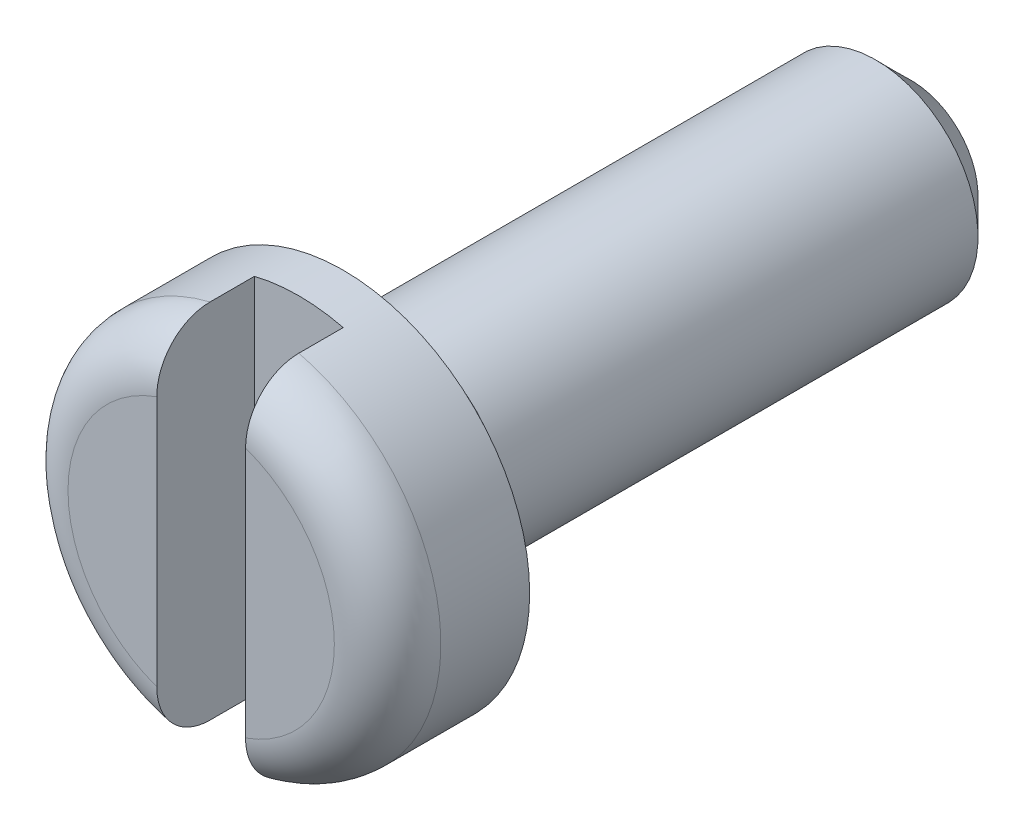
ISO-10303-21;
HEADER;
FILE_DESCRIPTION(('STEP AP214'),'2;1');
FILE_NAME('part.step','',(''),(''),'','','');
FILE_SCHEMA(('AUTOMOTIVE_DESIGN { 1 0 10303 214 1 1 1 1 }'));
ENDSEC;
DATA;
#1=APPLICATION_CONTEXT('core data for automotive mechanical design processes');
#2=APPLICATION_PROTOCOL_DEFINITION('international standard','automotive_design',2000,#1);
#3=PRODUCT_CONTEXT('',#1,'mechanical');
#4=PRODUCT('Part','Part','',(#3));
#5=PRODUCT_RELATED_PRODUCT_CATEGORY('part','',(#4));
#6=PRODUCT_DEFINITION_FORMATION('','',#4);
#7=PRODUCT_DEFINITION_CONTEXT('part definition',#1,'design');
#8=PRODUCT_DEFINITION('design','',#6,#7);
#9=PRODUCT_DEFINITION_SHAPE('','',#8);
#10=(LENGTH_UNIT() NAMED_UNIT(*) SI_UNIT(.MILLI.,.METRE.));
#11=(NAMED_UNIT(*) PLANE_ANGLE_UNIT() SI_UNIT($,.RADIAN.));
#12=(NAMED_UNIT(*) SI_UNIT($,.STERADIAN.) SOLID_ANGLE_UNIT());
#13=UNCERTAINTY_MEASURE_WITH_UNIT(LENGTH_MEASURE(1.E-05),#10,'distance_accuracy_value','');
#14=(GEOMETRIC_REPRESENTATION_CONTEXT(3) GLOBAL_UNCERTAINTY_ASSIGNED_CONTEXT((#13)) GLOBAL_UNIT_ASSIGNED_CONTEXT((#10,
#11,#12)) REPRESENTATION_CONTEXT('',''));
#15=CARTESIAN_POINT('',(0.,0.,0.));
#16=DIRECTION('',(0.,0.,1.));
#17=DIRECTION('',(1.,0.,0.));
#18=AXIS2_PLACEMENT_3D('',#15,#16,#17);
#19=CARTESIAN_POINT('',(0.,0.,1.6));
#20=DIRECTION('',(0.,0.,1.));
#21=DIRECTION('',(1.,0.,0.));
#22=AXIS2_PLACEMENT_3D('',#19,#20,#21);
#23=PLANE('',#22);
#24=DIRECTION('',(0.,-1.,0.));
#25=VECTOR('',#24,1.);
#26=CARTESIAN_POINT('',(-0.5,0.,1.6));
#27=LINE('',#26,#25);
#28=CARTESIAN_POINT('',(-0.5,1.4142135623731,1.6));
#29=VERTEX_POINT('',#28);
#30=CARTESIAN_POINT('',(-0.5,-1.4142135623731,1.6));
#31=VERTEX_POINT('',#30);
#32=EDGE_CURVE('E95',#29,#31,#27,.T.);
#33=ORIENTED_EDGE('',*,*,#32,.F.);
#34=CARTESIAN_POINT('',(0.,0.,1.6));
#35=DIRECTION('',(0.,0.,1.));
#36=DIRECTION('',(1.,0.,0.));
#37=AXIS2_PLACEMENT_3D('',#34,#35,#36);
#38=CIRCLE('',#37,1.5);
#39=EDGE_CURVE('E119',#29,#31,#38,.T.);
#40=ORIENTED_EDGE('',*,*,#39,.T.);
#41=EDGE_LOOP('',(#33,#40));
#42=FACE_BOUND('',#41,.T.);
#43=ADVANCED_FACE('F24',(#42),#23,.T.);
#44=CARTESIAN_POINT('',(0.,0.,1.));
#45=DIRECTION('',(0.,0.,1.));
#46=DIRECTION('',(1.,0.,0.));
#47=AXIS2_PLACEMENT_3D('',#44,#45,#46);
#48=TOROIDAL_SURFACE('',#47,1.5,0.6);
#49=CARTESIAN_POINT('',(-0.5,-1.99964689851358,1.21223347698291));
#50=CARTESIAN_POINT('',(-0.5,-2.01156673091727,1.18165302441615));
#51=CARTESIAN_POINT('',(-0.5,-2.02092214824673,1.15006159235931));
#52=CARTESIAN_POINT('',(-0.5,-2.03420012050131,1.08574395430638));
#53=CARTESIAN_POINT('',(-0.5,-2.03811994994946,1.05301718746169));
#54=CARTESIAN_POINT('',(-0.5,-2.04039563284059,0.987371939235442));
#55=CARTESIAN_POINT('',(-0.5,-2.03875192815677,0.954453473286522));
#56=CARTESIAN_POINT('',(-0.5,-2.02995378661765,0.889365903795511));
#57=CARTESIAN_POINT('',(-0.5,-2.02279989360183,0.857196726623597));
#58=CARTESIAN_POINT('',(-0.5,-2.00321865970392,0.794539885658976));
#59=CARTESIAN_POINT('',(-0.5,-1.99079615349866,0.764050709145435));
#60=CARTESIAN_POINT('',(-0.5,-1.96106630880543,0.705557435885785));
#61=CARTESIAN_POINT('',(-0.5,-1.94375877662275,0.677553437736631));
#62=CARTESIAN_POINT('',(-0.5,-1.90455349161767,0.6244526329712));
#63=CARTESIAN_POINT('',(-0.5,-1.88260363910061,0.599394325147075));
#64=CARTESIAN_POINT('',(-0.5,-1.83490308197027,0.553207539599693));
#65=CARTESIAN_POINT('',(-0.5,-1.80915201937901,0.532079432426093));
#66=CARTESIAN_POINT('',(-0.5,-1.75389034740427,0.493752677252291));
#67=CARTESIAN_POINT('',(-0.5,-1.7243002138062,0.476668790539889));
#68=CARTESIAN_POINT('',(-0.5,-1.66275438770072,0.447501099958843));
#69=CARTESIAN_POINT('',(-0.5,-1.63079832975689,0.435418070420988));
#70=CARTESIAN_POINT('',(-0.5,-1.56410675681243,0.416073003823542));
#71=CARTESIAN_POINT('',(-0.5,-1.52931144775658,0.409017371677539));
#72=CARTESIAN_POINT('',(-0.5,-1.45904380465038,0.400550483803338));
#73=CARTESIAN_POINT('',(-0.5,-1.42357131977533,0.399140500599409));
#74=CARTESIAN_POINT('',(-0.5,-1.35108451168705,0.401927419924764));
#75=CARTESIAN_POINT('',(-0.5,-1.31408104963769,0.406406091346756));
#76=CARTESIAN_POINT('',(-0.5,-1.24126423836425,0.421208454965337));
#77=CARTESIAN_POINT('',(-0.5,-1.20545115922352,0.431533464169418));
#78=CARTESIAN_POINT('',(-0.5,-1.13417944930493,0.458325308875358));
#79=CARTESIAN_POINT('',(-0.5,-1.09882466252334,0.475068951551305));
#80=CARTESIAN_POINT('',(-0.5,-1.0313298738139,0.514163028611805));
#81=CARTESIAN_POINT('',(-0.5,-0.99919206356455,0.536517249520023));
#82=CARTESIAN_POINT('',(-0.5,-0.938652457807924,0.586745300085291));
#83=CARTESIAN_POINT('',(-0.5,-0.910319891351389,0.614702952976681));
#84=CARTESIAN_POINT('',(-0.5,-0.859233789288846,0.675318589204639));
#85=CARTESIAN_POINT('',(-0.5,-0.836472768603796,0.707970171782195));
#86=CARTESIAN_POINT('',(-0.5,-0.802490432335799,0.768994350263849));
#87=CARTESIAN_POINT('',(-0.5,-0.78981346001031,0.796558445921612));
#88=CARTESIAN_POINT('',(-0.5,-0.769222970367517,0.85340723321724));
#89=CARTESIAN_POINT('',(-0.5,-0.761304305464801,0.882690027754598));
#90=CARTESIAN_POINT('',(-0.5,-0.750757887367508,0.942341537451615));
#91=CARTESIAN_POINT('',(-0.5,-0.74815377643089,0.972714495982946));
#92=CARTESIAN_POINT('',(-0.5,-0.748528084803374,1.03342787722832));
#93=CARTESIAN_POINT('',(-0.5,-0.751506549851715,1.06376829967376));
#94=CARTESIAN_POINT('',(-0.5,-0.762394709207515,1.12132246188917));
#95=CARTESIAN_POINT('',(-0.5,-0.769943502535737,1.14860616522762));
#96=CARTESIAN_POINT('',(-0.5,-0.789179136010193,1.20166601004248));
#97=CARTESIAN_POINT('',(-0.5,-0.800867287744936,1.22744167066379));
#98=CARTESIAN_POINT('',(-0.5,-0.82889681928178,1.27899767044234));
#99=CARTESIAN_POINT('',(-0.5,-0.845533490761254,1.30461659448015));
#100=CARTESIAN_POINT('',(-0.5,-0.882315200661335,1.35319089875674));
#101=CARTESIAN_POINT('',(-0.5,-0.902461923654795,1.37614499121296));
#102=CARTESIAN_POINT('',(-0.5,-0.949067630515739,1.42246367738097));
#103=CARTESIAN_POINT('',(-0.5,-0.976021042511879,1.44533169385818));
#104=CARTESIAN_POINT('',(-0.5,-1.03306909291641,1.48674639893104));
#105=CARTESIAN_POINT('',(-0.5,-1.0631653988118,1.50529077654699));
#106=CARTESIAN_POINT('',(-0.5,-1.1291001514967,1.53941199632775));
#107=CARTESIAN_POINT('',(-0.5,-1.16520935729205,1.55446871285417));
#108=CARTESIAN_POINT('',(-0.5,-1.23942611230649,1.57840607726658));
#109=CARTESIAN_POINT('',(-0.5,-1.27753394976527,1.58728583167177));
#110=CARTESIAN_POINT('',(-0.5,-1.35523785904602,1.59856860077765));
#111=CARTESIAN_POINT('',(-0.5,-1.39484711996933,1.60088192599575));
#112=CARTESIAN_POINT('',(-0.5,-1.47386106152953,1.59851603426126));
#113=CARTESIAN_POINT('',(-0.5,-1.51326578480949,1.59383833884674));
#114=CARTESIAN_POINT('',(-0.5,-1.58894762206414,1.57778917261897));
#115=CARTESIAN_POINT('',(-0.5,-1.62528651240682,1.56670972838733));
#116=CARTESIAN_POINT('',(-0.5,-1.69542326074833,1.5382626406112));
#117=CARTESIAN_POINT('',(-0.5,-1.72922156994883,1.52089611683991));
#118=CARTESIAN_POINT('',(-0.5,-1.79139186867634,1.48138259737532));
#119=CARTESIAN_POINT('',(-0.5,-1.81995682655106,1.45953887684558));
#120=CARTESIAN_POINT('',(-0.5,-1.87278431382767,1.41117493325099));
#121=CARTESIAN_POINT('',(-0.5,-1.89705092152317,1.38465919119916));
#122=CARTESIAN_POINT('',(-0.5,-1.93549452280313,1.33423884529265));
#123=CARTESIAN_POINT('',(-0.5,-1.95071039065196,1.31111809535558));
#124=CARTESIAN_POINT('',(-0.5,-1.97777146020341,1.26298118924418));
#125=CARTESIAN_POINT('',(-0.5,-1.9896170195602,1.23796523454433));
#126=CARTESIAN_POINT('',(-0.5,-1.99964689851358,1.21223347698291));
#127=B_SPLINE_CURVE_WITH_KNOTS('',3,(#49,#50,#51,#52,#53,#54,#55,#56,#57,#58,#59,#60,#61,#62,
#63,#64,#65,#66,#67,#68,#69,#70,#71,#72,#73,#74,#75,#76,#77,#78,#79,#80,#81,#82,#83,#84,#85,#86,
#87,#88,#89,#90,#91,#92,#93,#94,#95,#96,#97,#98,#99,#100,#101,#102,#103,#104,#105,#106,#107,
#108,#109,#110,#111,#112,#113,#114,#115,#116,#117,#118,#119,#120,#121,#122,#123,#124,#125,#126),
.UNSPECIFIED.,.T.,.F.,(4,2,2,2,2,2,2,2,2,2,2,2,2,2,2,2,2,2,2,2,2,2,2,2,2,2,2,2,2,2,2,2,2,2,2,2,
2,2,4),(0.,0.0983660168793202,0.196781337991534,0.29518884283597,0.393586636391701,
0.491894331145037,0.590205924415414,0.689685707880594,0.789174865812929,0.891217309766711,
0.993275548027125,1.09931419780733,1.20537674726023,1.31670366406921,1.42805566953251,
1.54487799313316,1.66177937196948,1.78058119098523,1.89922251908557,1.98986685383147,
2.08041295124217,2.17136098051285,2.26230975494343,2.34687306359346,2.4314631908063,
2.52275501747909,2.61409077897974,2.71970201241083,2.8253695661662,2.94219498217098,
3.05903729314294,3.17746802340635,3.29587298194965,3.4092608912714,3.52262861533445,
3.62996855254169,3.73720609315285,3.8199844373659,3.90275399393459),.UNSPECIFIED.);
#128=CARTESIAN_POINT('',(-0.5,-2.03960780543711,1.));
#129=VERTEX_POINT('',#128);
#130=EDGE_CURVE('E47',#31,#129,#127,.T.);
#131=ORIENTED_EDGE('',*,*,#130,.F.);
#132=ORIENTED_EDGE('',*,*,#39,.F.);
#133=CARTESIAN_POINT('',(-0.5,0.772599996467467,1.15466697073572));
#134=CARTESIAN_POINT('',(-0.5,0.763899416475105,1.12728531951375));
#135=CARTESIAN_POINT('',(-0.5,0.757412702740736,1.09919049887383));
#136=CARTESIAN_POINT('',(-0.5,0.749307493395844,1.04230286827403));
#137=CARTESIAN_POINT('',(-0.5,0.747687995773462,1.01351020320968));
#138=CARTESIAN_POINT('',(-0.5,0.749438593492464,0.956074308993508));
#139=CARTESIAN_POINT('',(-0.5,0.752809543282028,0.927431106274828));
#140=CARTESIAN_POINT('',(-0.5,0.764293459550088,0.871113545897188));
#141=CARTESIAN_POINT('',(-0.5,0.772408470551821,0.843439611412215));
#142=CARTESIAN_POINT('',(-0.5,0.792942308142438,0.789539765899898));
#143=CARTESIAN_POINT('',(-0.5,0.805390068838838,0.763324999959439));
#144=CARTESIAN_POINT('',(-0.5,0.833977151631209,0.713002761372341));
#145=CARTESIAN_POINT('',(-0.5,0.850117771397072,0.688896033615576));
#146=CARTESIAN_POINT('',(-0.5,0.888019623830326,0.639886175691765));
#147=CARTESIAN_POINT('',(-0.5,0.910252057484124,0.615347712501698));
#148=CARTESIAN_POINT('',(-0.5,0.958060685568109,0.569779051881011));
#149=CARTESIAN_POINT('',(-0.5,0.983638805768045,0.548750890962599));
#150=CARTESIAN_POINT('',(-0.5,1.04127151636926,0.507845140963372));
#151=CARTESIAN_POINT('',(-0.5,1.07373186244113,0.488536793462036));
#152=CARTESIAN_POINT('',(-0.5,1.14130979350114,0.455312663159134));
#153=CARTESIAN_POINT('',(-0.5,1.17642828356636,0.441398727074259));
#154=CARTESIAN_POINT('',(-0.5,1.25038064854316,0.418775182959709));
#155=CARTESIAN_POINT('',(-0.5,1.28931277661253,0.410384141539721));
#156=CARTESIAN_POINT('',(-0.5,1.36804626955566,0.400426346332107));
#157=CARTESIAN_POINT('',(-0.5,1.4078475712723,0.398859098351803));
#158=CARTESIAN_POINT('',(-0.5,1.4861656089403,0.402738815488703));
#159=CARTESIAN_POINT('',(-0.5,1.52469038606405,0.408019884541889));
#160=CARTESIAN_POINT('',(-0.5,1.60019331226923,0.425342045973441));
#161=CARTESIAN_POINT('',(-0.5,1.63717190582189,0.43738118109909));
#162=CARTESIAN_POINT('',(-0.5,1.70644533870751,0.467196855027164));
#163=CARTESIAN_POINT('',(-0.5,1.7388841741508,0.484638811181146));
#164=CARTESIAN_POINT('',(-0.5,1.80016448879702,0.524989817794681));
#165=CARTESIAN_POINT('',(-0.5,1.82900703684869,0.547897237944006));
#166=CARTESIAN_POINT('',(-0.5,1.88077906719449,0.597293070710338));
#167=CARTESIAN_POINT('',(-0.5,1.903929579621,0.623549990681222));
#168=CARTESIAN_POINT('',(-0.5,1.94529912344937,0.679698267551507));
#169=CARTESIAN_POINT('',(-0.5,1.96351923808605,0.709588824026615));
#170=CARTESIAN_POINT('',(-0.5,1.99385821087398,0.771009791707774));
#171=CARTESIAN_POINT('',(-0.5,2.00616950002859,0.802445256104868));
#172=CARTESIAN_POINT('',(-0.5,2.02521830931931,0.866961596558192));
#173=CARTESIAN_POINT('',(-0.5,2.03195656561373,0.900042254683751));
#174=CARTESIAN_POINT('',(-0.5,2.0395595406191,0.966200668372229));
#175=CARTESIAN_POINT('',(-0.5,2.04053875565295,0.999265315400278));
#176=CARTESIAN_POINT('',(-0.5,2.03689912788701,1.06508385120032));
#177=CARTESIAN_POINT('',(-0.5,2.03228058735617,1.09783775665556));
#178=CARTESIAN_POINT('',(-0.5,2.01763364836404,1.16192635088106));
#179=CARTESIAN_POINT('',(-0.5,2.00763426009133,1.19326768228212));
#180=CARTESIAN_POINT('',(-0.5,1.98255923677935,1.25384696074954));
#181=CARTESIAN_POINT('',(-0.5,1.96748352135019,1.28308487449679));
#182=CARTESIAN_POINT('',(-0.5,1.93256863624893,1.33891428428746));
#183=CARTESIAN_POINT('',(-0.5,1.91268930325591,1.36548063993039));
#184=CARTESIAN_POINT('',(-0.5,1.86884253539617,1.41498884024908));
#185=CARTESIAN_POINT('',(-0.5,1.84487477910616,1.43793039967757));
#186=CARTESIAN_POINT('',(-0.5,1.79297405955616,1.48010891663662));
#187=CARTESIAN_POINT('',(-0.5,1.76496410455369,1.49925105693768));
#188=CARTESIAN_POINT('',(-0.5,1.70621840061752,1.53274771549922));
#189=CARTESIAN_POINT('',(-0.5,1.6754822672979,1.547101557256));
#190=CARTESIAN_POINT('',(-0.5,1.61098629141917,1.57118610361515));
#191=CARTESIAN_POINT('',(-0.5,1.5771574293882,1.58073177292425));
#192=CARTESIAN_POINT('',(-0.5,1.50841164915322,1.59428924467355));
#193=CARTESIAN_POINT('',(-0.5,1.47349450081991,1.59829986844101));
#194=CARTESIAN_POINT('',(-0.5,1.40179301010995,1.60088611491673));
#195=CARTESIAN_POINT('',(-0.5,1.364999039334,1.59919340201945));
#196=CARTESIAN_POINT('',(-0.5,1.29215404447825,1.58997004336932));
#197=CARTESIAN_POINT('',(-0.5,1.25610316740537,1.58243825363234));
#198=CARTESIAN_POINT('',(-0.5,1.18382026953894,1.56130965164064));
#199=CARTESIAN_POINT('',(-0.5,1.14767284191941,1.54742301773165));
#200=CARTESIAN_POINT('',(-0.5,1.07809474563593,1.51394463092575));
#201=CARTESIAN_POINT('',(-0.5,1.04466605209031,1.49434877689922));
#202=CARTESIAN_POINT('',(-0.5,0.980565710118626,1.44927309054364));
#203=CARTESIAN_POINT('',(-0.5,0.950002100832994,1.42363913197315));
#204=CARTESIAN_POINT('',(-0.5,0.893903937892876,1.36737392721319));
#205=CARTESIAN_POINT('',(-0.5,0.868362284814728,1.33674984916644));
#206=CARTESIAN_POINT('',(-0.5,0.830295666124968,1.28098262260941));
#207=CARTESIAN_POINT('',(-0.5,0.816160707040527,1.25693018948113));
#208=CARTESIAN_POINT('',(-0.5,0.791526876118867,1.2070295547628));
#209=CARTESIAN_POINT('',(-0.5,0.781025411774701,1.18118264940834));
#210=CARTESIAN_POINT('',(-0.5,0.772599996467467,1.15466697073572));
#211=B_SPLINE_CURVE_WITH_KNOTS('',3,(#133,#134,#135,#136,#137,#138,#139,#140,#141,#142,#143,
#144,#145,#146,#147,#148,#149,#150,#151,#152,#153,#154,#155,#156,#157,#158,#159,#160,#161,#162,
#163,#164,#165,#166,#167,#168,#169,#170,#171,#172,#173,#174,#175,#176,#177,#178,#179,#180,#181,
#182,#183,#184,#185,#186,#187,#188,#189,#190,#191,#192,#193,#194,#195,#196,#197,#198,#199,#200,
#201,#202,#203,#204,#205,#206,#207,#208,#209,#210),.UNSPECIFIED.,.T.,.F.,(4,2,2,2,2,2,2,2,2,2,2,
2,2,2,2,2,2,2,2,2,2,2,2,2,2,2,2,2,2,2,2,2,2,2,2,2,2,2,4),(0.,0.0861004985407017,
0.17218327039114,0.258280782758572,0.344415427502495,0.431136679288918,0.517888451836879,
0.616838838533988,0.715846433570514,0.828658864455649,0.941509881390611,1.06040365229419,
1.17928881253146,1.29534715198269,1.41137189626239,1.52130225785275,1.63119986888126,
1.73569320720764,1.84016356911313,1.94095132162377,2.04172575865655,2.14048972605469,
2.23924836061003,2.33747980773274,2.43571281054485,2.5347974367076,2.63388985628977,
2.73520870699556,2.83654186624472,2.94152301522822,3.0465265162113,3.1565379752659,
3.26657099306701,3.38221768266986,3.49794765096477,3.61703308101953,3.7359489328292,
3.81938607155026,3.90276355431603),.UNSPECIFIED.);
#212=CARTESIAN_POINT('',(-0.5,2.03960780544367,0.999999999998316));
#213=VERTEX_POINT('',#212);
#214=EDGE_CURVE('E156',#213,#29,#211,.T.);
#215=ORIENTED_EDGE('',*,*,#214,.F.);
#216=CARTESIAN_POINT('',(0.,0.,1.));
#217=DIRECTION('',(0.,0.,1.));
#218=DIRECTION('',(1.,0.,0.));
#219=AXIS2_PLACEMENT_3D('',#216,#217,#218);
#220=CIRCLE('',#219,2.1);
#221=EDGE_CURVE('E121',#129,#213,#220,.F.);
#222=ORIENTED_EDGE('',*,*,#221,.F.);
#223=EDGE_LOOP('',(#131,#132,#215,#222));
#224=FACE_BOUND('',#223,.T.);
#225=ADVANCED_FACE('F171',(#224),#48,.T.);
#226=CARTESIAN_POINT('',(0.,0.,0.));
#227=DIRECTION('',(0.,0.,1.));
#228=DIRECTION('',(1.,0.,0.));
#229=AXIS2_PLACEMENT_3D('',#226,#227,#228);
#230=PLANE('',#229);
#231=CARTESIAN_POINT('',(0.,0.,0.));
#232=DIRECTION('',(0.,0.,1.));
#233=DIRECTION('',(1.,0.,0.));
#234=AXIS2_PLACEMENT_3D('',#231,#232,#233);
#235=CIRCLE('',#234,2.1);
#236=CARTESIAN_POINT('',(2.1,0.,0.));
#237=VERTEX_POINT('',#236);
#238=EDGE_CURVE('E113',#237,#237,#235,.T.);
#239=ORIENTED_EDGE('',*,*,#238,.F.);
#240=EDGE_LOOP('',(#239));
#241=FACE_BOUND('',#240,.T.);
#242=CARTESIAN_POINT('',(0.,0.,0.));
#243=DIRECTION('',(0.,0.,1.));
#244=DIRECTION('',(1.,0.,0.));
#245=AXIS2_PLACEMENT_3D('',#242,#243,#244);
#246=CIRCLE('',#245,0.749999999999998);
#247=CARTESIAN_POINT('',(0.749999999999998,0.,0.));
#248=VERTEX_POINT('',#247);
#249=EDGE_CURVE('E106',#248,#248,#246,.T.);
#250=ORIENTED_EDGE('',*,*,#249,.T.);
#251=EDGE_LOOP('',(#250));
#252=FACE_BOUND('',#251,.T.);
#253=ADVANCED_FACE('F179',(#241,#252),#230,.F.);
#254=CARTESIAN_POINT('',(0.,0.,1.6));
#255=DIRECTION('',(0.,0.,-1.));
#256=DIRECTION('',(-1.,0.,0.));
#257=AXIS2_PLACEMENT_3D('',#254,#255,#256);
#258=CYLINDRICAL_SURFACE('',#257,2.1);
#259=CARTESIAN_POINT('',(0.,0.,0.5));
#260=DIRECTION('',(0.,0.,-1.));
#261=DIRECTION('',(-1.,0.,0.));
#262=AXIS2_PLACEMENT_3D('',#259,#260,#261);
#263=CIRCLE('',#262,2.1);
#264=CARTESIAN_POINT('',(0.499999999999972,-2.03960780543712,0.5));
#265=VERTEX_POINT('',#264);
#266=CARTESIAN_POINT('',(-0.5,-2.03960780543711,0.5));
#267=VERTEX_POINT('',#266);
#268=EDGE_CURVE('E11',#265,#267,#263,.T.);
#269=ORIENTED_EDGE('',*,*,#268,.T.);
#270=DIRECTION('',(0.,0.,-1.));
#271=VECTOR('',#270,1.);
#272=CARTESIAN_POINT('',(-0.5,-2.03960780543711,1.6));
#273=LINE('',#272,#271);
#274=EDGE_CURVE('E104',#267,#129,#273,.F.);
#275=ORIENTED_EDGE('',*,*,#274,.T.);
#276=ORIENTED_EDGE('',*,*,#221,.T.);
#277=DIRECTION('',(0.,0.,-1.));
#278=VECTOR('',#277,1.);
#279=CARTESIAN_POINT('',(-0.5,2.03960780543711,1.6));
#280=LINE('',#279,#278);
#281=CARTESIAN_POINT('',(-0.5,2.03960780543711,0.5));
#282=VERTEX_POINT('',#281);
#283=EDGE_CURVE('E97',#213,#282,#280,.T.);
#284=ORIENTED_EDGE('',*,*,#283,.T.);
#285=CARTESIAN_POINT('',(0.499999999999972,2.03960780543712,0.5));
#286=VERTEX_POINT('',#285);
#287=EDGE_CURVE('E28',#282,#286,#263,.T.);
#288=ORIENTED_EDGE('',*,*,#287,.T.);
#289=DIRECTION('',(0.,0.,-1.));
#290=VECTOR('',#289,1.);
#291=CARTESIAN_POINT('',(0.499999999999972,2.03960780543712,1.6));
#292=LINE('',#291,#290);
#293=CARTESIAN_POINT('',(0.499999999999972,2.0396078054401,1.00000000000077));
#294=VERTEX_POINT('',#293);
#295=EDGE_CURVE('E89',#286,#294,#292,.F.);
#296=ORIENTED_EDGE('',*,*,#295,.T.);
#297=CARTESIAN_POINT('',(0.499999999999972,-2.03960780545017,1.00000000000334));
#298=VERTEX_POINT('',#297);
#299=EDGE_CURVE('E94',#294,#298,#220,.F.);
#300=ORIENTED_EDGE('',*,*,#299,.T.);
#301=DIRECTION('',(0.,0.,-1.));
#302=VECTOR('',#301,1.);
#303=CARTESIAN_POINT('',(0.499999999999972,-2.03960780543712,1.6));
#304=LINE('',#303,#302);
#305=EDGE_CURVE('E86',#298,#265,#304,.T.);
#306=ORIENTED_EDGE('',*,*,#305,.T.);
#307=EDGE_LOOP('',(#269,#275,#276,#284,#288,#296,#300,#306));
#308=FACE_BOUND('',#307,.T.);
#309=ORIENTED_EDGE('',*,*,#238,.T.);
#310=EDGE_LOOP('',(#309));
#311=FACE_BOUND('',#310,.T.);
#312=ADVANCED_FACE('F26',(#308,#311),#258,.T.);
#313=DIRECTION('',(0.,1.,0.));
#314=VECTOR('',#313,1.);
#315=CARTESIAN_POINT('',(0.499999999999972,0.,1.6));
#316=LINE('',#315,#314);
#317=CARTESIAN_POINT('',(0.499999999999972,-1.41421356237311,1.6));
#318=VERTEX_POINT('',#317);
#319=CARTESIAN_POINT('',(0.499999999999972,1.41421356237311,1.6));
#320=VERTEX_POINT('',#319);
#321=EDGE_CURVE('E39',#318,#320,#316,.T.);
#322=ORIENTED_EDGE('',*,*,#321,.F.);
#323=EDGE_CURVE('E116',#318,#320,#38,.T.);
#324=ORIENTED_EDGE('',*,*,#323,.T.);
#325=EDGE_LOOP('',(#322,#324));
#326=FACE_BOUND('',#325,.T.);
#327=ADVANCED_FACE('F166',(#326),#23,.T.);
#328=CARTESIAN_POINT('',(0.499999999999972,-1.99964689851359,1.21223347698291));
#329=CARTESIAN_POINT('',(0.499999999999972,-1.98743987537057,1.24354459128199));
#330=CARTESIAN_POINT('',(0.499999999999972,-1.97253379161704,1.27382239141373));
#331=CARTESIAN_POINT('',(0.499999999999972,-1.93780309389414,1.33143351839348));
#332=CARTESIAN_POINT('',(0.499999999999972,-1.9179739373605,1.35876409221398));
#333=CARTESIAN_POINT('',(0.499999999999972,-1.87405915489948,1.40968880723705));
#334=CARTESIAN_POINT('',(0.499999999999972,-1.84997959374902,1.43328818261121));
#335=CARTESIAN_POINT('',(0.499999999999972,-1.79828051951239,1.47620474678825));
#336=CARTESIAN_POINT('',(0.499999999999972,-1.77066148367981,1.49552251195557));
#337=CARTESIAN_POINT('',(0.499999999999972,-1.7120482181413,1.52982219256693));
#338=CARTESIAN_POINT('',(0.499999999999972,-1.68099392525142,1.54470133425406));
#339=CARTESIAN_POINT('',(0.499999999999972,-1.61689891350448,1.56926953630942));
#340=CARTESIAN_POINT('',(0.499999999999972,-1.58385781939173,1.57895761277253));
#341=CARTESIAN_POINT('',(0.499999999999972,-1.51525349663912,1.59331938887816));
#342=CARTESIAN_POINT('',(0.499999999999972,-1.47964263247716,1.5977651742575));
#343=CARTESIAN_POINT('',(0.499999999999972,-1.40817028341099,1.60092494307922));
#344=CARTESIAN_POINT('',(0.499999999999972,-1.3723087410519,1.59963756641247));
#345=CARTESIAN_POINT('',(0.499999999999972,-1.29940747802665,1.59129248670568));
#346=CARTESIAN_POINT('',(0.499999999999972,-1.2624010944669,1.58394350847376));
#347=CARTESIAN_POINT('',(0.499999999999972,-1.19004120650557,1.56341749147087));
#348=CARTESIAN_POINT('',(0.499999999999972,-1.15468811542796,1.55023900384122));
#349=CARTESIAN_POINT('',(0.499999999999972,-1.08496478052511,1.51771878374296));
#350=CARTESIAN_POINT('',(0.499999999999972,-1.05071211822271,1.49812429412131));
#351=CARTESIAN_POINT('',(0.499999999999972,-0.985940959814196,1.45345777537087));
#352=CARTESIAN_POINT('',(0.499999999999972,-0.955425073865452,1.42838195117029));
#353=CARTESIAN_POINT('',(0.499999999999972,-0.899227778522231,1.37328702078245));
#354=CARTESIAN_POINT('',(0.499999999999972,-0.873544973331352,1.343269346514));
#355=CARTESIAN_POINT('',(0.499999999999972,-0.828311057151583,1.27893305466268));
#356=CARTESIAN_POINT('',(0.499999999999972,-0.808748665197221,1.24462251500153));
#357=CARTESIAN_POINT('',(0.499999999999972,-0.781215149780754,1.18183443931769));
#358=CARTESIAN_POINT('',(0.499999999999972,-0.771561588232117,1.15409131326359));
#359=CARTESIAN_POINT('',(0.499999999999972,-0.757044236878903,1.09738531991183));
#360=CARTESIAN_POINT('',(0.499999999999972,-0.752175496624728,1.06842374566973));
#361=CARTESIAN_POINT('',(0.499999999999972,-0.747573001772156,1.01001561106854));
#362=CARTESIAN_POINT('',(0.499999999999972,-0.747852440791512,0.980567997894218));
#363=CARTESIAN_POINT('',(0.499999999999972,-0.753556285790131,0.922172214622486));
#364=CARTESIAN_POINT('',(0.499999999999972,-0.758982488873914,0.893224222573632));
#365=CARTESIAN_POINT('',(0.499999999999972,-0.774320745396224,0.837601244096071));
#366=CARTESIAN_POINT('',(0.499999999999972,-0.784077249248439,0.810882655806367));
#367=CARTESIAN_POINT('',(0.499999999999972,-0.807486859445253,0.759220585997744));
#368=CARTESIAN_POINT('',(0.499999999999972,-0.821141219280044,0.73427767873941));
#369=CARTESIAN_POINT('',(0.499999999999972,-0.853512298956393,0.683857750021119));
#370=CARTESIAN_POINT('',(0.499999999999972,-0.872625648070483,0.658636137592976));
#371=CARTESIAN_POINT('',(0.499999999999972,-0.91428764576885,0.611215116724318));
#372=CARTESIAN_POINT('',(0.499999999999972,-0.936838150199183,0.589017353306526));
#373=CARTESIAN_POINT('',(0.499999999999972,-0.988450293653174,0.544789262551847));
#374=CARTESIAN_POINT('',(0.499999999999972,-1.01798027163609,0.523303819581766));
#375=CARTESIAN_POINT('',(0.499999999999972,-1.08000274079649,0.48513885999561));
#376=CARTESIAN_POINT('',(0.499999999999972,-1.11249658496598,0.468461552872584));
#377=CARTESIAN_POINT('',(0.499999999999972,-1.18244746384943,0.43913396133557));
#378=CARTESIAN_POINT('',(0.499999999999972,-1.22009278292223,0.426929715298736));
#379=CARTESIAN_POINT('',(0.499999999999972,-1.2969086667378,0.409044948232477));
#380=CARTESIAN_POINT('',(0.499999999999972,-1.33607929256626,0.403364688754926));
#381=CARTESIAN_POINT('',(0.499999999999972,-1.41461638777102,0.39886821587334));
#382=CARTESIAN_POINT('',(0.499999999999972,-1.45398075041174,0.400016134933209));
#383=CARTESIAN_POINT('',(0.499999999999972,-1.53189117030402,0.409254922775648));
#384=CARTESIAN_POINT('',(0.499999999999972,-1.5704374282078,0.417344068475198));
#385=CARTESIAN_POINT('',(0.499999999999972,-1.64360296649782,0.439836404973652));
#386=CARTESIAN_POINT('',(0.499999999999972,-1.6783220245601,0.453914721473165));
#387=CARTESIAN_POINT('',(0.499999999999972,-1.74471135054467,0.488013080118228));
#388=CARTESIAN_POINT('',(0.499999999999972,-1.77638256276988,0.508031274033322));
#389=CARTESIAN_POINT('',(0.499999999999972,-1.83402641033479,0.552297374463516));
#390=CARTESIAN_POINT('',(0.499999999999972,-1.86020981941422,0.576270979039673));
#391=CARTESIAN_POINT('',(0.499999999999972,-1.90797174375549,0.628434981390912));
#392=CARTESIAN_POINT('',(0.499999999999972,-1.92955149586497,0.656624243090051));
#393=CARTESIAN_POINT('',(0.499999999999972,-1.96660576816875,0.715192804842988));
#394=CARTESIAN_POINT('',(0.499999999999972,-1.98228949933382,0.74543987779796));
#395=CARTESIAN_POINT('',(0.499999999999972,-2.00821188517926,0.808190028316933));
#396=CARTESIAN_POINT('',(0.499999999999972,-2.01845051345,0.840693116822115));
#397=CARTESIAN_POINT('',(0.499999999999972,-2.03295846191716,0.906175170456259));
#398=CARTESIAN_POINT('',(0.499999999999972,-2.03736630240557,0.939123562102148));
#399=CARTESIAN_POINT('',(0.499999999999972,-2.0405221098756,1.00527080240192));
#400=CARTESIAN_POINT('',(0.499999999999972,-2.03927514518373,1.03846940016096));
#401=CARTESIAN_POINT('',(0.499999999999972,-2.03225879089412,1.09541705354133));
#402=CARTESIAN_POINT('',(0.499999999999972,-2.02777898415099,1.11933323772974));
#403=CARTESIAN_POINT('',(0.499999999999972,-2.01588525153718,1.16642410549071));
#404=CARTESIAN_POINT('',(0.499999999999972,-2.00847131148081,1.18959878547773));
#405=CARTESIAN_POINT('',(0.499999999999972,-1.99964689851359,1.21223347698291));
#406=B_SPLINE_CURVE_WITH_KNOTS('',3,(#328,#329,#330,#331,#332,#333,#334,#335,#336,#337,#338,
#339,#340,#341,#342,#343,#344,#345,#346,#347,#348,#349,#350,#351,#352,#353,#354,#355,#356,#357,
#358,#359,#360,#361,#362,#363,#364,#365,#366,#367,#368,#369,#370,#371,#372,#373,#374,#375,#376,
#377,#378,#379,#380,#381,#382,#383,#384,#385,#386,#387,#388,#389,#390,#391,#392,#393,#394,#395,
#396,#397,#398,#399,#400,#401,#402,#403,#404,#405),.UNSPECIFIED.,.T.,.F.,(4,2,2,2,2,2,2,2,2,2,2,
2,2,2,2,2,2,2,2,2,2,2,2,2,2,2,2,2,2,2,2,2,2,2,2,2,2,2,4),(0.,0.100729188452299,0.20155166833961,
0.302231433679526,0.402897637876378,0.505740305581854,0.608602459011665,0.715788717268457,
0.823000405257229,0.935686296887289,1.04840021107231,1.16623380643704,1.28414924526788,
1.40203057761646,1.51969333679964,1.60744527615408,1.69510633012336,1.78299207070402,
1.87090850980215,1.95589454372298,2.04090793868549,2.13548221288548,2.23010773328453,
2.33920605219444,2.44835442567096,2.56651235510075,2.68467502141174,2.80221754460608,
2.91973089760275,3.03155121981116,3.14333678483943,3.24930546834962,3.35524564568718,
3.45695959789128,3.55867404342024,3.65792589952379,3.75708881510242,3.82990522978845,
3.90272199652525),.UNSPECIFIED.);
#407=EDGE_CURVE('E136',#298,#318,#406,.T.);
#408=ORIENTED_EDGE('',*,*,#407,.F.);
#409=ORIENTED_EDGE('',*,*,#299,.F.);
#410=CARTESIAN_POINT('',(0.499999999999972,0.772599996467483,1.15466697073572));
#411=CARTESIAN_POINT('',(0.499999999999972,0.782909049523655,1.18709959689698));
#412=CARTESIAN_POINT('',(0.499999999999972,0.79633925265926,1.21857276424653));
#413=CARTESIAN_POINT('',(0.499999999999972,0.82848953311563,1.2787296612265));
#414=CARTESIAN_POINT('',(0.499999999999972,0.847223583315,1.30740575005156));
#415=CARTESIAN_POINT('',(0.499999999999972,0.888891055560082,1.36119613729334));
#416=CARTESIAN_POINT('',(0.499999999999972,0.911795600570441,1.38633294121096));
#417=CARTESIAN_POINT('',(0.499999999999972,0.961086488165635,1.43287497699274));
#418=CARTESIAN_POINT('',(0.499999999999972,0.987471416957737,1.45428171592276));
#419=CARTESIAN_POINT('',(0.499999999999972,1.04617898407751,1.49522998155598));
#420=CARTESIAN_POINT('',(0.499999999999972,1.07883567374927,1.51429397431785));
#421=CARTESIAN_POINT('',(0.499999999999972,1.14677260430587,1.54699700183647));
#422=CARTESIAN_POINT('',(0.499999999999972,1.18205401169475,1.56063360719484));
#423=CARTESIAN_POINT('',(0.499999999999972,1.25625262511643,1.58263840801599));
#424=CARTESIAN_POINT('',(0.499999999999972,1.29526347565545,1.59069342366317));
#425=CARTESIAN_POINT('',(0.499999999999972,1.37409573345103,1.59996038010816));
#426=CARTESIAN_POINT('',(0.499999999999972,1.41391707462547,1.60117287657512));
#427=CARTESIAN_POINT('',(0.499999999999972,1.4921571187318,1.59658576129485));
#428=CARTESIAN_POINT('',(0.499999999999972,1.53058592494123,1.59096156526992));
#429=CARTESIAN_POINT('',(0.499999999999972,1.60583662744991,1.57297418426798));
#430=CARTESIAN_POINT('',(0.499999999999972,1.64265900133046,1.56061301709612));
#431=CARTESIAN_POINT('',(0.499999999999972,1.71156615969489,1.53020584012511));
#432=CARTESIAN_POINT('',(0.499999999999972,1.74379837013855,1.5124939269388));
#433=CARTESIAN_POINT('',(0.499999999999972,1.80462230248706,1.47164539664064));
#434=CARTESIAN_POINT('',(0.499999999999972,1.83321508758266,1.44851036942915));
#435=CARTESIAN_POINT('',(0.499999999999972,1.88447392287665,1.39871303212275));
#436=CARTESIAN_POINT('',(0.499999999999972,1.90736138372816,1.37227846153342));
#437=CARTESIAN_POINT('',(0.499999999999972,1.94818007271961,1.31582485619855));
#438=CARTESIAN_POINT('',(0.499999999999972,1.9661123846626,1.28580660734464));
#439=CARTESIAN_POINT('',(0.499999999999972,1.99587773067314,1.22417562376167));
#440=CARTESIAN_POINT('',(0.499999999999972,2.00790158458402,1.19265494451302));
#441=CARTESIAN_POINT('',(0.499999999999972,2.02636751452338,1.12801920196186));
#442=CARTESIAN_POINT('',(0.499999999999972,2.03281031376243,1.094904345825));
#443=CARTESIAN_POINT('',(0.499999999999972,2.03983162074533,1.02871633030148));
#444=CARTESIAN_POINT('',(0.499999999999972,2.04052240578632,0.995655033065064));
#445=CARTESIAN_POINT('',(0.499999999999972,2.03631277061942,0.929891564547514));
#446=CARTESIAN_POINT('',(0.499999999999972,2.03141264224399,0.897189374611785));
#447=CARTESIAN_POINT('',(0.499999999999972,2.01621692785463,0.833237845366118));
#448=CARTESIAN_POINT('',(0.499999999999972,2.0059483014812,0.801982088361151));
#449=CARTESIAN_POINT('',(0.499999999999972,1.98035462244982,0.741616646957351));
#450=CARTESIAN_POINT('',(0.499999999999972,1.96502948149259,0.712507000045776));
#451=CARTESIAN_POINT('',(0.499999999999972,1.92963437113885,0.656963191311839));
#452=CARTESIAN_POINT('',(0.499999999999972,1.90952283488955,0.630555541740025));
#453=CARTESIAN_POINT('',(0.499999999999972,1.8652422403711,0.581399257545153));
#454=CARTESIAN_POINT('',(0.499999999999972,1.84107285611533,0.558650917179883));
#455=CARTESIAN_POINT('',(0.499999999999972,1.78879110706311,0.516883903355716));
#456=CARTESIAN_POINT('',(0.499999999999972,1.76060135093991,0.497962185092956));
#457=CARTESIAN_POINT('',(0.499999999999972,1.70153489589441,0.464930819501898));
#458=CARTESIAN_POINT('',(0.499999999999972,1.67065781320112,0.450821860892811));
#459=CARTESIAN_POINT('',(0.499999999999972,1.60590615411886,0.427249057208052));
#460=CARTESIAN_POINT('',(0.499999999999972,1.57196342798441,0.417972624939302));
#461=CARTESIAN_POINT('',(0.499999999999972,1.50303470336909,0.404966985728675));
#462=CARTESIAN_POINT('',(0.499999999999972,1.46804848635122,0.401238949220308));
#463=CARTESIAN_POINT('',(0.499999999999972,1.39624353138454,0.39923717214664));
#464=CARTESIAN_POINT('',(0.499999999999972,1.35941731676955,0.401233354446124));
#465=CARTESIAN_POINT('',(0.499999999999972,1.28655576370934,0.411065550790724));
#466=CARTESIAN_POINT('',(0.499999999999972,1.25052060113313,0.418902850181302));
#467=CARTESIAN_POINT('',(0.499999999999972,1.17832282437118,0.440653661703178));
#468=CARTESIAN_POINT('',(0.499999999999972,1.14224717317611,0.454856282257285));
#469=CARTESIAN_POINT('',(0.499999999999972,1.07287071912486,0.488955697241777));
#470=CARTESIAN_POINT('',(0.499999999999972,1.03957162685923,0.508855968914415));
#471=CARTESIAN_POINT('',(0.499999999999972,0.975836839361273,0.554505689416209));
#472=CARTESIAN_POINT('',(0.499999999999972,0.945505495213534,0.580401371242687));
#473=CARTESIAN_POINT('',(0.499999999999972,0.889919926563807,0.63716724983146));
#474=CARTESIAN_POINT('',(0.499999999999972,0.864660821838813,0.668032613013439));
#475=CARTESIAN_POINT('',(0.499999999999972,0.825205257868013,0.727074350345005));
#476=CARTESIAN_POINT('',(0.499999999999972,0.809799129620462,0.75444365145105));
#477=CARTESIAN_POINT('',(0.499999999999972,0.78372407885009,0.811360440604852));
#478=CARTESIAN_POINT('',(0.499999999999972,0.773051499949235,0.840906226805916));
#479=CARTESIAN_POINT('',(0.499999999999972,0.757104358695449,0.901638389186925));
#480=CARTESIAN_POINT('',(0.499999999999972,0.751864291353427,0.932833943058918));
#481=CARTESIAN_POINT('',(0.499999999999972,0.747364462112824,0.995632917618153));
#482=CARTESIAN_POINT('',(0.499999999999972,0.748095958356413,1.027235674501));
#483=CARTESIAN_POINT('',(0.499999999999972,0.753679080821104,1.07478272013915));
#484=CARTESIAN_POINT('',(0.499999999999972,0.756399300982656,1.09100655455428));
#485=CARTESIAN_POINT('',(0.499999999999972,0.763370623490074,1.12311711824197));
#486=CARTESIAN_POINT('',(0.499999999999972,0.767621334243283,1.13900393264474));
#487=CARTESIAN_POINT('',(0.499999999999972,0.772599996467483,1.15466697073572));
#488=B_SPLINE_CURVE_WITH_KNOTS('',3,(#410,#411,#412,#413,#414,#415,#416,#417,#418,#419,#420,
#421,#422,#423,#424,#425,#426,#427,#428,#429,#430,#431,#432,#433,#434,#435,#436,#437,#438,#439,
#440,#441,#442,#443,#444,#445,#446,#447,#448,#449,#450,#451,#452,#453,#454,#455,#456,#457,#458,
#459,#460,#461,#462,#463,#464,#465,#466,#467,#468,#469,#470,#471,#472,#473,#474,#475,#476,#477,
#478,#479,#480,#481,#482,#483,#484,#485,#486,#487),.UNSPECIFIED.,.T.,.F.,(4,2,2,2,2,2,2,2,2,2,2,
2,2,2,2,2,2,2,2,2,2,2,2,2,2,2,2,2,2,2,2,2,2,2,2,2,2,2,4),(0.,0.102024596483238,
0.204320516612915,0.305933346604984,0.407505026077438,0.520454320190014,0.633454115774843,
0.752369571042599,0.871275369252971,0.987193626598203,1.10307718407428,1.21285077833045,
1.32259223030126,1.42696856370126,1.53132204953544,1.63203797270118,1.73274084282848,
1.83147330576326,1.93020061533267,2.028436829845,2.1266747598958,2.22579913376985,
2.32493147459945,2.42632597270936,2.52773497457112,2.63282877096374,2.73794473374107,
2.84809771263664,2.9582749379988,3.07406298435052,3.18992184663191,3.30897731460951,
3.42791767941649,3.52175825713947,3.61552622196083,3.70988600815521,3.80410768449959,
3.85339212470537,3.90266396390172),.UNSPECIFIED.);
#489=EDGE_CURVE('E128',#320,#294,#488,.T.);
#490=ORIENTED_EDGE('',*,*,#489,.F.);
#491=ORIENTED_EDGE('',*,*,#323,.F.);
#492=EDGE_LOOP('',(#408,#409,#490,#491));
#493=FACE_BOUND('',#492,.T.);
#494=ADVANCED_FACE('F140',(#493),#48,.T.);
#495=CARTESIAN_POINT('',(0.,0.,-1.08540680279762));
#496=DIRECTION('',(0.,0.,-1.));
#497=DIRECTION('',(-1.,0.,0.));
#498=AXIS2_PLACEMENT_3D('',#495,#496,#497);
#499=CONICAL_SURFACE('',#498,1.50432677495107,0.711957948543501);
#500=CARTESIAN_POINT('',(0.,0.,-0.21126982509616));
#501=DIRECTION('',(0.,0.,1.));
#502=DIRECTION('',(1.,0.,0.));
#503=AXIS2_PLACEMENT_3D('',#500,#501,#502);
#504=CIRCLE('',#503,0.749999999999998);
#505=CARTESIAN_POINT('',(0.749999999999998,0.,-0.21126982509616));
#506=VERTEX_POINT('',#505);
#507=EDGE_CURVE('E109',#506,#506,#504,.T.);
#508=ORIENTED_EDGE('',*,*,#507,.F.);
#509=EDGE_LOOP('',(#508));
#510=FACE_BOUND('',#509,.T.);
#511=CARTESIAN_POINT('',(0.,0.,-0.674802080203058));
#512=DIRECTION('',(0.,0.,-1.));
#513=DIRECTION('',(-1.,0.,0.));
#514=AXIS2_PLACEMENT_3D('',#511,#512,#513);
#515=CIRCLE('',#514,1.15);
#516=CARTESIAN_POINT('',(-1.15,0.,-0.674802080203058));
#517=VERTEX_POINT('',#516);
#518=EDGE_CURVE('E112',#517,#517,#515,.T.);
#519=ORIENTED_EDGE('',*,*,#518,.F.);
#520=EDGE_LOOP('',(#519));
#521=FACE_BOUND('',#520,.T.);
#522=ADVANCED_FACE('F185',(#510,#521),#499,.T.);
#523=CARTESIAN_POINT('',(0.,0.,0.101807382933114));
#524=DIRECTION('',(0.,0.,1.));
#525=DIRECTION('',(1.,0.,0.));
#526=AXIS2_PLACEMENT_3D('',#523,#524,#525);
#527=CYLINDRICAL_SURFACE('',#526,0.749999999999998);
#528=ORIENTED_EDGE('',*,*,#249,.F.);
#529=EDGE_LOOP('',(#528));
#530=FACE_BOUND('',#529,.T.);
#531=ORIENTED_EDGE('',*,*,#507,.T.);
#532=EDGE_LOOP('',(#531));
#533=FACE_BOUND('',#532,.T.);
#534=ADVANCED_FACE('F153',(#530,#533),#527,.T.);
#535=CARTESIAN_POINT('',(0.,0.,-6.4));
#536=DIRECTION('',(0.,0.,-1.));
#537=DIRECTION('',(-1.,0.,0.));
#538=AXIS2_PLACEMENT_3D('',#535,#536,#537);
#539=PLANE('',#538);
#540=CARTESIAN_POINT('',(0.,0.,-6.4));
#541=DIRECTION('',(0.,0.,-1.));
#542=DIRECTION('',(-1.,0.,0.));
#543=AXIS2_PLACEMENT_3D('',#540,#541,#542);
#544=CIRCLE('',#543,0.749999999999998);
#545=CARTESIAN_POINT('',(-0.749999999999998,0.,-6.4));
#546=VERTEX_POINT('',#545);
#547=EDGE_CURVE('E122',#546,#546,#544,.T.);
#548=ORIENTED_EDGE('',*,*,#547,.T.);
#549=EDGE_LOOP('',(#548));
#550=FACE_BOUND('',#549,.T.);
#551=ADVANCED_FACE('F198',(#550),#539,.T.);
#552=CARTESIAN_POINT('',(0.,0.,-6.4));
#553=DIRECTION('',(0.,0.,1.));
#554=DIRECTION('',(1.,0.,0.));
#555=AXIS2_PLACEMENT_3D('',#552,#553,#554);
#556=CONICAL_SURFACE('',#555,0.749999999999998,0.785398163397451);
#557=CARTESIAN_POINT('',(0.,0.,-6.));
#558=DIRECTION('',(0.,0.,-1.));
#559=DIRECTION('',(-1.,0.,0.));
#560=AXIS2_PLACEMENT_3D('',#557,#558,#559);
#561=CIRCLE('',#560,1.15);
#562=CARTESIAN_POINT('',(-1.15,0.,-6.));
#563=VERTEX_POINT('',#562);
#564=EDGE_CURVE('E125',#563,#563,#561,.F.);
#565=ORIENTED_EDGE('',*,*,#564,.F.);
#566=EDGE_LOOP('',(#565));
#567=FACE_BOUND('',#566,.T.);
#568=ORIENTED_EDGE('',*,*,#547,.F.);
#569=EDGE_LOOP('',(#568));
#570=FACE_BOUND('',#569,.T.);
#571=ADVANCED_FACE('F208',(#567,#570),#556,.T.);
#572=CARTESIAN_POINT('',(0.,0.,-6.4));
#573=DIRECTION('',(0.,0.,1.));
#574=DIRECTION('',(1.,0.,0.));
#575=AXIS2_PLACEMENT_3D('',#572,#573,#574);
#576=CYLINDRICAL_SURFACE('',#575,1.15);
#577=ORIENTED_EDGE('',*,*,#518,.T.);
#578=EDGE_LOOP('',(#577));
#579=FACE_BOUND('',#578,.T.);
#580=ORIENTED_EDGE('',*,*,#564,.T.);
#581=EDGE_LOOP('',(#580));
#582=FACE_BOUND('',#581,.T.);
#583=ADVANCED_FACE('F205',(#579,#582),#576,.T.);
#584=CARTESIAN_POINT('',(-0.5,-3.,0.5));
#585=DIRECTION('',(0.,0.,-1.));
#586=DIRECTION('',(-1.,0.,0.));
#587=AXIS2_PLACEMENT_3D('',#584,#585,#586);
#588=PLANE('',#587);
#589=DIRECTION('',(0.,1.,0.));
#590=VECTOR('',#589,1.);
#591=CARTESIAN_POINT('',(-0.5,-3.,0.5));
#592=LINE('',#591,#590);
#593=EDGE_CURVE('E82',#267,#282,#592,.T.);
#594=ORIENTED_EDGE('',*,*,#593,.F.);
#595=ORIENTED_EDGE('',*,*,#268,.F.);
#596=DIRECTION('',(0.,1.,0.));
#597=VECTOR('',#596,1.);
#598=CARTESIAN_POINT('',(0.499999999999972,-3.,0.5));
#599=LINE('',#598,#597);
#600=EDGE_CURVE('E79',#265,#286,#599,.T.);
#601=ORIENTED_EDGE('',*,*,#600,.T.);
#602=ORIENTED_EDGE('',*,*,#287,.F.);
#603=EDGE_LOOP('',(#594,#595,#601,#602));
#604=FACE_BOUND('',#603,.T.);
#605=ADVANCED_FACE('F78',(#604),#588,.F.);
#606=CARTESIAN_POINT('',(-0.5,-3.,0.5));
#607=DIRECTION('',(-1.,0.,0.));
#608=DIRECTION('',(0.,0.,1.));
#609=AXIS2_PLACEMENT_3D('',#606,#607,#608);
#610=PLANE('',#609);
#611=ORIENTED_EDGE('',*,*,#593,.T.);
#612=ORIENTED_EDGE('',*,*,#283,.F.);
#613=ORIENTED_EDGE('',*,*,#214,.T.);
#614=ORIENTED_EDGE('',*,*,#32,.T.);
#615=ORIENTED_EDGE('',*,*,#130,.T.);
#616=ORIENTED_EDGE('',*,*,#274,.F.);
#617=EDGE_LOOP('',(#611,#612,#613,#614,#615,#616));
#618=FACE_BOUND('',#617,.T.);
#619=ADVANCED_FACE('F148',(#618),#610,.F.);
#620=CARTESIAN_POINT('',(0.499999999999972,-3.,0.5));
#621=DIRECTION('',(1.,0.,0.));
#622=DIRECTION('',(0.,0.,-1.));
#623=AXIS2_PLACEMENT_3D('',#620,#621,#622);
#624=PLANE('',#623);
#625=ORIENTED_EDGE('',*,*,#407,.T.);
#626=ORIENTED_EDGE('',*,*,#321,.T.);
#627=ORIENTED_EDGE('',*,*,#489,.T.);
#628=ORIENTED_EDGE('',*,*,#295,.F.);
#629=ORIENTED_EDGE('',*,*,#600,.F.);
#630=ORIENTED_EDGE('',*,*,#305,.F.);
#631=EDGE_LOOP('',(#625,#626,#627,#628,#629,#630));
#632=FACE_BOUND('',#631,.T.);
#633=ADVANCED_FACE('F85',(#632),#624,.F.);
#634=CLOSED_SHELL('',(#43,#225,#253,#312,#327,#494,#522,#534,#551,#571,#583,#605,#619,#633));
#635=MANIFOLD_SOLID_BREP('B2',#634);
#636=ADVANCED_BREP_SHAPE_REPRESENTATION('',(#18,#635),#14);
#637=SHAPE_DEFINITION_REPRESENTATION(#9,#636);
ENDSEC;
END-ISO-10303-21;
